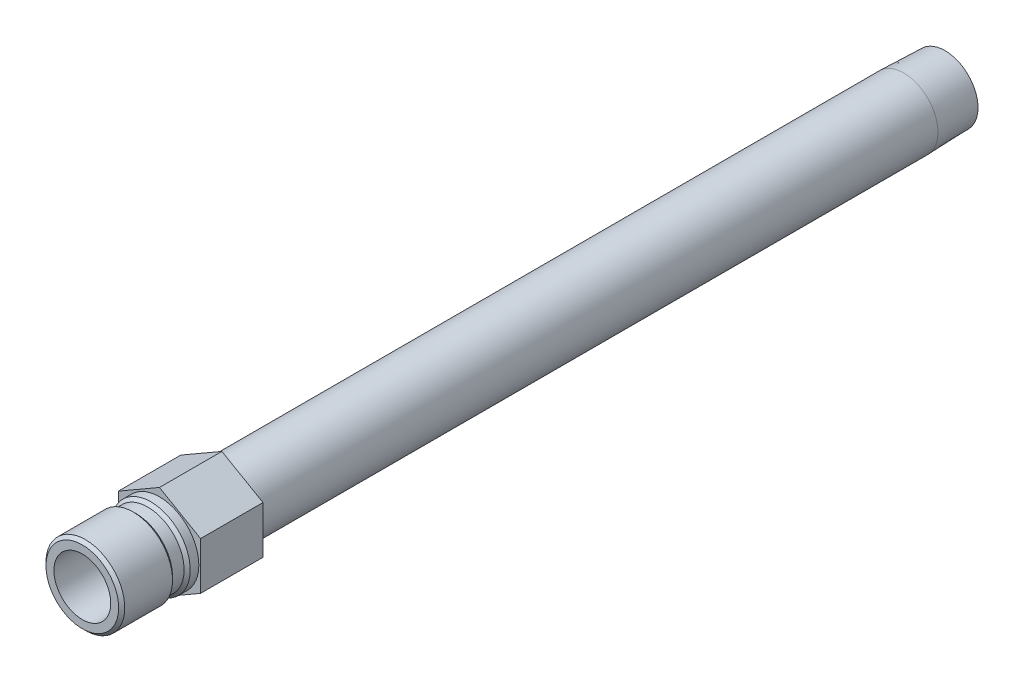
ISO-10303-21;
HEADER;
FILE_DESCRIPTION(('STEP AP214'),'2;1');
FILE_NAME('part.step','',(''),(''),'','','');
FILE_SCHEMA(('AUTOMOTIVE_DESIGN { 1 0 10303 214 1 1 1 1 }'));
ENDSEC;
DATA;
#1=APPLICATION_CONTEXT('core data for automotive mechanical design processes');
#2=APPLICATION_PROTOCOL_DEFINITION('international standard','automotive_design',2000,#1);
#3=PRODUCT_CONTEXT('',#1,'mechanical');
#4=PRODUCT('Part','Part','',(#3));
#5=PRODUCT_RELATED_PRODUCT_CATEGORY('part','',(#4));
#6=PRODUCT_DEFINITION_FORMATION('','',#4);
#7=PRODUCT_DEFINITION_CONTEXT('part definition',#1,'design');
#8=PRODUCT_DEFINITION('design','',#6,#7);
#9=PRODUCT_DEFINITION_SHAPE('','',#8);
#10=(LENGTH_UNIT() NAMED_UNIT(*) SI_UNIT(.MILLI.,.METRE.));
#11=(NAMED_UNIT(*) PLANE_ANGLE_UNIT() SI_UNIT($,.RADIAN.));
#12=(NAMED_UNIT(*) SI_UNIT($,.STERADIAN.) SOLID_ANGLE_UNIT());
#13=UNCERTAINTY_MEASURE_WITH_UNIT(LENGTH_MEASURE(1.E-05),#10,'distance_accuracy_value','');
#14=(GEOMETRIC_REPRESENTATION_CONTEXT(3) GLOBAL_UNCERTAINTY_ASSIGNED_CONTEXT((#13)) GLOBAL_UNIT_ASSIGNED_CONTEXT((#10,
#11,#12)) REPRESENTATION_CONTEXT('',''));
#15=CARTESIAN_POINT('',(0.,0.,0.));
#16=DIRECTION('',(0.,0.,1.));
#17=DIRECTION('',(1.,0.,0.));
#18=AXIS2_PLACEMENT_3D('',#15,#16,#17);
#19=CARTESIAN_POINT('',(0.,0.,0.));
#20=DIRECTION('',(0.,0.,-1.));
#21=DIRECTION('',(0.,1.,0.));
#22=AXIS2_PLACEMENT_3D('',#19,#20,#21);
#23=CYLINDRICAL_SURFACE('',#22,8.5725);
#24=CARTESIAN_POINT('',(0.,0.,-186.2582));
#25=DIRECTION('',(0.,0.,-1.));
#26=DIRECTION('',(0.,1.,0.));
#27=AXIS2_PLACEMENT_3D('',#24,#25,#26);
#28=CIRCLE('',#27,8.5725);
#29=CARTESIAN_POINT('',(0.,8.5725,-186.2582));
#30=VERTEX_POINT('',#29);
#31=EDGE_CURVE('E158',#30,#30,#28,.T.);
#32=ORIENTED_EDGE('',*,*,#31,.F.);
#33=EDGE_LOOP('',(#32));
#34=FACE_BOUND('',#33,.T.);
#35=CARTESIAN_POINT('',(0.,0.,-15.621));
#36=DIRECTION('',(0.,0.,1.));
#37=DIRECTION('',(1.,0.,0.));
#38=AXIS2_PLACEMENT_3D('',#35,#36,#37);
#39=CIRCLE('',#38,8.5725);
#40=CARTESIAN_POINT('',(8.5725,0.,-15.621));
#41=VERTEX_POINT('',#40);
#42=EDGE_CURVE('E39',#41,#41,#39,.F.);
#43=ORIENTED_EDGE('',*,*,#42,.T.);
#44=EDGE_LOOP('',(#43));
#45=FACE_BOUND('',#44,.T.);
#46=ADVANCED_FACE('F35',(#34,#45),#23,.T.);
#47=CARTESIAN_POINT('',(0.,0.,0.));
#48=DIRECTION('',(0.,0.,-1.));
#49=DIRECTION('',(0.,1.,0.));
#50=AXIS2_PLACEMENT_3D('',#47,#48,#49);
#51=CYLINDRICAL_SURFACE('',#50,7.112);
#52=CARTESIAN_POINT('',(0.,0.,1.524));
#53=DIRECTION('',(0.,0.,-1.));
#54=DIRECTION('',(0.,1.,0.));
#55=AXIS2_PLACEMENT_3D('',#52,#53,#54);
#56=CIRCLE('',#55,7.112);
#57=CARTESIAN_POINT('',(0.,7.112,1.524));
#58=VERTEX_POINT('',#57);
#59=EDGE_CURVE('E146',#58,#58,#56,.T.);
#60=ORIENTED_EDGE('',*,*,#59,.T.);
#61=EDGE_LOOP('',(#60));
#62=FACE_BOUND('',#61,.T.);
#63=CARTESIAN_POINT('',(0.,0.,19.304));
#64=DIRECTION('',(0.,0.,-1.));
#65=DIRECTION('',(0.,1.,0.));
#66=AXIS2_PLACEMENT_3D('',#63,#64,#65);
#67=CIRCLE('',#66,7.112);
#68=CARTESIAN_POINT('',(0.,7.112,19.304));
#69=VERTEX_POINT('',#68);
#70=EDGE_CURVE('E11',#69,#69,#67,.T.);
#71=ORIENTED_EDGE('',*,*,#70,.F.);
#72=EDGE_LOOP('',(#71));
#73=FACE_BOUND('',#72,.T.);
#74=ADVANCED_FACE('F37',(#62,#73),#51,.F.);
#75=CARTESIAN_POINT('',(0.,7.112,19.304));
#76=DIRECTION('',(0.,0.,1.));
#77=DIRECTION('',(0.,-1.,0.));
#78=AXIS2_PLACEMENT_3D('',#75,#76,#77);
#79=PLANE('',#78);
#80=ORIENTED_EDGE('',*,*,#70,.T.);
#81=EDGE_LOOP('',(#80));
#82=FACE_BOUND('',#81,.T.);
#83=CARTESIAN_POINT('',(0.,0.,19.304));
#84=DIRECTION('',(0.,0.,-1.));
#85=DIRECTION('',(0.,1.,0.));
#86=AXIS2_PLACEMENT_3D('',#83,#84,#85);
#87=CIRCLE('',#86,9.09319999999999);
#88=CARTESIAN_POINT('',(0.,9.0932,19.304));
#89=VERTEX_POINT('',#88);
#90=EDGE_CURVE('E45',#89,#89,#87,.T.);
#91=ORIENTED_EDGE('',*,*,#90,.F.);
#92=EDGE_LOOP('',(#91));
#93=FACE_BOUND('',#92,.T.);
#94=ADVANCED_FACE('F185',(#82,#93),#79,.T.);
#95=CARTESIAN_POINT('',(0.,0.,18.542));
#96=DIRECTION('',(0.,0.,-1.));
#97=DIRECTION('',(0.,1.,0.));
#98=AXIS2_PLACEMENT_3D('',#95,#96,#97);
#99=CONICAL_SURFACE('',#98,9.8552,0.785398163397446);
#100=ORIENTED_EDGE('',*,*,#90,.T.);
#101=EDGE_LOOP('',(#100));
#102=FACE_BOUND('',#101,.T.);
#103=CARTESIAN_POINT('',(0.,0.,18.542));
#104=DIRECTION('',(0.,0.,-1.));
#105=DIRECTION('',(0.,1.,0.));
#106=AXIS2_PLACEMENT_3D('',#103,#104,#105);
#107=CIRCLE('',#106,9.8552);
#108=CARTESIAN_POINT('',(0.,9.8552,18.542));
#109=VERTEX_POINT('',#108);
#110=EDGE_CURVE('E176',#109,#109,#107,.T.);
#111=ORIENTED_EDGE('',*,*,#110,.F.);
#112=EDGE_LOOP('',(#111));
#113=FACE_BOUND('',#112,.T.);
#114=ADVANCED_FACE('F182',(#102,#113),#99,.T.);
#115=CARTESIAN_POINT('',(0.,0.,0.));
#116=DIRECTION('',(0.,0.,-1.));
#117=DIRECTION('',(0.,1.,0.));
#118=AXIS2_PLACEMENT_3D('',#115,#116,#117);
#119=CYLINDRICAL_SURFACE('',#118,9.8552);
#120=ORIENTED_EDGE('',*,*,#110,.T.);
#121=EDGE_LOOP('',(#120));
#122=FACE_BOUND('',#121,.T.);
#123=CARTESIAN_POINT('',(0.,0.,6.5786));
#124=DIRECTION('',(0.,0.,-1.));
#125=DIRECTION('',(0.,1.,0.));
#126=AXIS2_PLACEMENT_3D('',#123,#124,#125);
#127=CIRCLE('',#126,9.8552);
#128=CARTESIAN_POINT('',(0.,9.8552,6.5786));
#129=VERTEX_POINT('',#128);
#130=EDGE_CURVE('E173',#129,#129,#127,.T.);
#131=ORIENTED_EDGE('',*,*,#130,.F.);
#132=EDGE_LOOP('',(#131));
#133=FACE_BOUND('',#132,.T.);
#134=ADVANCED_FACE('F192',(#122,#133),#119,.T.);
#135=CARTESIAN_POINT('',(0.,0.,5.8166));
#136=DIRECTION('',(0.,0.,1.));
#137=DIRECTION('',(0.,-1.,0.));
#138=AXIS2_PLACEMENT_3D('',#135,#136,#137);
#139=CONICAL_SURFACE('',#138,9.0932,0.785398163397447);
#140=ORIENTED_EDGE('',*,*,#130,.T.);
#141=EDGE_LOOP('',(#140));
#142=FACE_BOUND('',#141,.T.);
#143=CARTESIAN_POINT('',(0.,0.,5.8166));
#144=DIRECTION('',(0.,0.,-1.));
#145=DIRECTION('',(0.,1.,0.));
#146=AXIS2_PLACEMENT_3D('',#143,#144,#145);
#147=CIRCLE('',#146,9.0932);
#148=CARTESIAN_POINT('',(0.,9.0932,5.8166));
#149=VERTEX_POINT('',#148);
#150=EDGE_CURVE('E170',#149,#149,#147,.T.);
#151=ORIENTED_EDGE('',*,*,#150,.F.);
#152=EDGE_LOOP('',(#151));
#153=FACE_BOUND('',#152,.T.);
#154=ADVANCED_FACE('F217',(#142,#153),#139,.T.);
#155=CARTESIAN_POINT('',(0.,0.,0.));
#156=DIRECTION('',(0.,0.,-1.));
#157=DIRECTION('',(0.,1.,0.));
#158=AXIS2_PLACEMENT_3D('',#155,#156,#157);
#159=CYLINDRICAL_SURFACE('',#158,9.0932);
#160=ORIENTED_EDGE('',*,*,#150,.T.);
#161=EDGE_LOOP('',(#160));
#162=FACE_BOUND('',#161,.T.);
#163=CARTESIAN_POINT('',(0.,0.,2.921));
#164=DIRECTION('',(0.,0.,-1.));
#165=DIRECTION('',(0.,1.,0.));
#166=AXIS2_PLACEMENT_3D('',#163,#164,#165);
#167=CIRCLE('',#166,9.0932);
#168=CARTESIAN_POINT('',(0.,9.0932,2.921));
#169=VERTEX_POINT('',#168);
#170=EDGE_CURVE('E167',#169,#169,#167,.T.);
#171=ORIENTED_EDGE('',*,*,#170,.F.);
#172=EDGE_LOOP('',(#171));
#173=FACE_BOUND('',#172,.T.);
#174=ADVANCED_FACE('F213',(#162,#173),#159,.T.);
#175=CARTESIAN_POINT('',(0.,0.,2.159));
#176=DIRECTION('',(0.,0.,-1.));
#177=DIRECTION('',(0.,1.,0.));
#178=AXIS2_PLACEMENT_3D('',#175,#176,#177);
#179=CONICAL_SURFACE('',#178,9.8552,0.785398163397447);
#180=ORIENTED_EDGE('',*,*,#170,.T.);
#181=EDGE_LOOP('',(#180));
#182=FACE_BOUND('',#181,.T.);
#183=CARTESIAN_POINT('',(0.,0.,2.159));
#184=DIRECTION('',(0.,0.,-1.));
#185=DIRECTION('',(0.,1.,0.));
#186=AXIS2_PLACEMENT_3D('',#183,#184,#185);
#187=CIRCLE('',#186,9.8552);
#188=CARTESIAN_POINT('',(0.,9.8552,2.159));
#189=VERTEX_POINT('',#188);
#190=EDGE_CURVE('E164',#189,#189,#187,.T.);
#191=ORIENTED_EDGE('',*,*,#190,.F.);
#192=EDGE_LOOP('',(#191));
#193=FACE_BOUND('',#192,.T.);
#194=ADVANCED_FACE('F209',(#182,#193),#179,.T.);
#195=CARTESIAN_POINT('',(0.,0.,0.));
#196=DIRECTION('',(0.,0.,-1.));
#197=DIRECTION('',(0.,1.,0.));
#198=AXIS2_PLACEMENT_3D('',#195,#196,#197);
#199=CYLINDRICAL_SURFACE('',#198,9.8552);
#200=ORIENTED_EDGE('',*,*,#190,.T.);
#201=EDGE_LOOP('',(#200));
#202=FACE_BOUND('',#201,.T.);
#203=CARTESIAN_POINT('',(0.,0.,0.));
#204=DIRECTION('',(0.,0.,-1.));
#205=DIRECTION('',(0.,1.,0.));
#206=AXIS2_PLACEMENT_3D('',#203,#204,#205);
#207=CIRCLE('',#206,9.8552);
#208=CARTESIAN_POINT('',(0.,9.8552,0.));
#209=VERTEX_POINT('',#208);
#210=EDGE_CURVE('E161',#209,#209,#207,.T.);
#211=ORIENTED_EDGE('',*,*,#210,.F.);
#212=EDGE_LOOP('',(#211));
#213=FACE_BOUND('',#212,.T.);
#214=ADVANCED_FACE('F206',(#202,#213),#199,.T.);
#215=CARTESIAN_POINT('',(0.,0.,-196.596));
#216=DIRECTION('',(0.,0.,1.));
#217=DIRECTION('',(0.,-1.,0.));
#218=AXIS2_PLACEMENT_3D('',#215,#216,#217);
#219=CONICAL_SURFACE('',#218,8.24944566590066,0.0312396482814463);
#220=ORIENTED_EDGE('',*,*,#31,.T.);
#221=EDGE_LOOP('',(#220));
#222=FACE_BOUND('',#221,.T.);
#223=CARTESIAN_POINT('',(0.,0.,-196.596));
#224=DIRECTION('',(0.,0.,-1.));
#225=DIRECTION('',(0.,1.,0.));
#226=AXIS2_PLACEMENT_3D('',#223,#224,#225);
#227=CIRCLE('',#226,8.24944566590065);
#228=CARTESIAN_POINT('',(0.,8.24944566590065,-196.596));
#229=VERTEX_POINT('',#228);
#230=EDGE_CURVE('E155',#229,#229,#227,.T.);
#231=ORIENTED_EDGE('',*,*,#230,.F.);
#232=EDGE_LOOP('',(#231));
#233=FACE_BOUND('',#232,.T.);
#234=ADVANCED_FACE('F204',(#222,#233),#219,.T.);
#235=CARTESIAN_POINT('',(0.,8.24944566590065,-196.596));
#236=DIRECTION('',(0.,0.,-1.));
#237=DIRECTION('',(0.,1.,0.));
#238=AXIS2_PLACEMENT_3D('',#235,#236,#237);
#239=PLANE('',#238);
#240=ORIENTED_EDGE('',*,*,#230,.T.);
#241=EDGE_LOOP('',(#240));
#242=FACE_BOUND('',#241,.T.);
#243=CARTESIAN_POINT('',(0.,0.,-196.596));
#244=DIRECTION('',(0.,0.,-1.));
#245=DIRECTION('',(0.,1.,0.));
#246=AXIS2_PLACEMENT_3D('',#243,#244,#245);
#247=CIRCLE('',#246,6.2611);
#248=CARTESIAN_POINT('',(0.,6.2611,-196.596));
#249=VERTEX_POINT('',#248);
#250=EDGE_CURVE('E152',#249,#249,#247,.T.);
#251=ORIENTED_EDGE('',*,*,#250,.F.);
#252=EDGE_LOOP('',(#251));
#253=FACE_BOUND('',#252,.T.);
#254=ADVANCED_FACE('F270',(#242,#253),#239,.T.);
#255=CARTESIAN_POINT('',(0.,0.,0.));
#256=DIRECTION('',(0.,0.,-1.));
#257=DIRECTION('',(0.,1.,0.));
#258=AXIS2_PLACEMENT_3D('',#255,#256,#257);
#259=CYLINDRICAL_SURFACE('',#258,6.2611);
#260=ORIENTED_EDGE('',*,*,#250,.T.);
#261=EDGE_LOOP('',(#260));
#262=FACE_BOUND('',#261,.T.);
#263=CARTESIAN_POINT('',(0.,0.,1.07156844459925));
#264=DIRECTION('',(0.,0.,-1.));
#265=DIRECTION('',(0.,1.,0.));
#266=AXIS2_PLACEMENT_3D('',#263,#264,#265);
#267=CIRCLE('',#266,6.2611);
#268=CARTESIAN_POINT('',(0.,6.2611,1.07156844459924));
#269=VERTEX_POINT('',#268);
#270=EDGE_CURVE('E149',#269,#269,#267,.T.);
#271=ORIENTED_EDGE('',*,*,#270,.F.);
#272=EDGE_LOOP('',(#271));
#273=FACE_BOUND('',#272,.T.);
#274=ADVANCED_FACE('F267',(#262,#273),#259,.F.);
#275=CARTESIAN_POINT('',(0.,0.,1.524));
#276=DIRECTION('',(0.,0.,1.));
#277=DIRECTION('',(0.,-1.,0.));
#278=AXIS2_PLACEMENT_3D('',#275,#276,#277);
#279=CONICAL_SURFACE('',#278,7.112,1.08210413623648);
#280=ORIENTED_EDGE('',*,*,#270,.T.);
#281=EDGE_LOOP('',(#280));
#282=FACE_BOUND('',#281,.T.);
#283=ORIENTED_EDGE('',*,*,#59,.F.);
#284=EDGE_LOOP('',(#283));
#285=FACE_BOUND('',#284,.T.);
#286=ADVANCED_FACE('F255',(#282,#285),#279,.F.);
#287=CARTESIAN_POINT('',(0.,11.8784044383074,-15.621));
#288=DIRECTION('',(-0.5,0.866025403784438,0.));
#289=DIRECTION('',(-0.866025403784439,-0.5,0.));
#290=AXIS2_PLACEMENT_3D('',#287,#288,#289);
#291=PLANE('',#290);
#292=DIRECTION('',(-0.866025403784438,-0.5,0.));
#293=VECTOR('',#292,1.);
#294=CARTESIAN_POINT('',(0.,11.8784044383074,0.));
#295=LINE('',#294,#293);
#296=CARTESIAN_POINT('',(0.,11.8784044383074,0.));
#297=VERTEX_POINT('',#296);
#298=CARTESIAN_POINT('',(-10.287,5.93920221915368,0.));
#299=VERTEX_POINT('',#298);
#300=EDGE_CURVE('E124',#297,#299,#295,.T.);
#301=ORIENTED_EDGE('',*,*,#300,.F.);
#302=DIRECTION('',(0.,0.,1.));
#303=VECTOR('',#302,1.);
#304=CARTESIAN_POINT('',(0.,11.8784044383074,-15.621));
#305=LINE('',#304,#303);
#306=CARTESIAN_POINT('',(0.,11.8784044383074,-15.621));
#307=VERTEX_POINT('',#306);
#308=EDGE_CURVE('E53',#307,#297,#305,.T.);
#309=ORIENTED_EDGE('',*,*,#308,.F.);
#310=DIRECTION('',(-0.866025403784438,-0.5,0.));
#311=VECTOR('',#310,1.);
#312=CARTESIAN_POINT('',(0.,11.8784044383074,-15.621));
#313=LINE('',#312,#311);
#314=CARTESIAN_POINT('',(-10.287,5.93920221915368,-15.621));
#315=VERTEX_POINT('',#314);
#316=EDGE_CURVE('E139',#307,#315,#313,.T.);
#317=ORIENTED_EDGE('',*,*,#316,.T.);
#318=DIRECTION('',(0.,0.,1.));
#319=VECTOR('',#318,1.);
#320=CARTESIAN_POINT('',(-10.287,5.93920221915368,-15.621));
#321=LINE('',#320,#319);
#322=EDGE_CURVE('E88',#315,#299,#321,.T.);
#323=ORIENTED_EDGE('',*,*,#322,.T.);
#324=EDGE_LOOP('',(#301,#309,#317,#323));
#325=FACE_BOUND('',#324,.T.);
#326=ADVANCED_FACE('F242',(#325),#291,.T.);
#327=CARTESIAN_POINT('',(10.287,5.93920221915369,-15.621));
#328=DIRECTION('',(0.5,0.866025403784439,0.));
#329=DIRECTION('',(-0.866025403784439,0.5,0.));
#330=AXIS2_PLACEMENT_3D('',#327,#328,#329);
#331=PLANE('',#330);
#332=DIRECTION('',(-0.866025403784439,0.5,0.));
#333=VECTOR('',#332,1.);
#334=CARTESIAN_POINT('',(10.287,5.93920221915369,0.));
#335=LINE('',#334,#333);
#336=CARTESIAN_POINT('',(10.287,5.93920221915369,0.));
#337=VERTEX_POINT('',#336);
#338=EDGE_CURVE('E136',#337,#297,#335,.T.);
#339=ORIENTED_EDGE('',*,*,#338,.F.);
#340=DIRECTION('',(0.,0.,1.));
#341=VECTOR('',#340,1.);
#342=CARTESIAN_POINT('',(10.287,5.93920221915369,-15.621));
#343=LINE('',#342,#341);
#344=CARTESIAN_POINT('',(10.287,5.93920221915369,-15.621));
#345=VERTEX_POINT('',#344);
#346=EDGE_CURVE('E76',#345,#337,#343,.T.);
#347=ORIENTED_EDGE('',*,*,#346,.F.);
#348=DIRECTION('',(-0.866025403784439,0.5,0.));
#349=VECTOR('',#348,1.);
#350=CARTESIAN_POINT('',(10.287,5.93920221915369,-15.621));
#351=LINE('',#350,#349);
#352=EDGE_CURVE('E114',#345,#307,#351,.T.);
#353=ORIENTED_EDGE('',*,*,#352,.T.);
#354=ORIENTED_EDGE('',*,*,#308,.T.);
#355=EDGE_LOOP('',(#339,#347,#353,#354));
#356=FACE_BOUND('',#355,.T.);
#357=ADVANCED_FACE('F247',(#356),#331,.T.);
#358=CARTESIAN_POINT('',(10.287,-5.93920221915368,-15.621));
#359=DIRECTION('',(1.,0.,0.));
#360=DIRECTION('',(0.,0.,-1.));
#361=AXIS2_PLACEMENT_3D('',#358,#359,#360);
#362=PLANE('',#361);
#363=DIRECTION('',(0.,1.,0.));
#364=VECTOR('',#363,1.);
#365=CARTESIAN_POINT('',(10.287,-5.93920221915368,0.));
#366=LINE('',#365,#364);
#367=CARTESIAN_POINT('',(10.287,-5.93920221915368,0.));
#368=VERTEX_POINT('',#367);
#369=EDGE_CURVE('E101',#368,#337,#366,.T.);
#370=ORIENTED_EDGE('',*,*,#369,.F.);
#371=DIRECTION('',(0.,0.,1.));
#372=VECTOR('',#371,1.);
#373=CARTESIAN_POINT('',(10.287,-5.93920221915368,-15.621));
#374=LINE('',#373,#372);
#375=CARTESIAN_POINT('',(10.287,-5.93920221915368,-15.621));
#376=VERTEX_POINT('',#375);
#377=EDGE_CURVE('E96',#376,#368,#374,.T.);
#378=ORIENTED_EDGE('',*,*,#377,.F.);
#379=DIRECTION('',(0.,1.,0.));
#380=VECTOR('',#379,1.);
#381=CARTESIAN_POINT('',(10.287,-5.93920221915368,-15.621));
#382=LINE('',#381,#380);
#383=EDGE_CURVE('E99',#376,#345,#382,.T.);
#384=ORIENTED_EDGE('',*,*,#383,.T.);
#385=ORIENTED_EDGE('',*,*,#346,.T.);
#386=EDGE_LOOP('',(#370,#378,#384,#385));
#387=FACE_BOUND('',#386,.T.);
#388=ADVANCED_FACE('F98',(#387),#362,.T.);
#389=CARTESIAN_POINT('',(0.,-11.8784044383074,-15.621));
#390=DIRECTION('',(0.5,-0.866025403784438,0.));
#391=DIRECTION('',(0.866025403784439,0.5,0.));
#392=AXIS2_PLACEMENT_3D('',#389,#390,#391);
#393=PLANE('',#392);
#394=DIRECTION('',(0.866025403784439,0.5,0.));
#395=VECTOR('',#394,1.);
#396=CARTESIAN_POINT('',(0.,-11.8784044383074,0.));
#397=LINE('',#396,#395);
#398=CARTESIAN_POINT('',(0.,-11.8784044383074,0.));
#399=VERTEX_POINT('',#398);
#400=EDGE_CURVE('E133',#399,#368,#397,.T.);
#401=ORIENTED_EDGE('',*,*,#400,.F.);
#402=DIRECTION('',(0.,0.,1.));
#403=VECTOR('',#402,1.);
#404=CARTESIAN_POINT('',(0.,-11.8784044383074,-15.621));
#405=LINE('',#404,#403);
#406=CARTESIAN_POINT('',(0.,-11.8784044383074,-15.621));
#407=VERTEX_POINT('',#406);
#408=EDGE_CURVE('E106',#407,#399,#405,.T.);
#409=ORIENTED_EDGE('',*,*,#408,.F.);
#410=DIRECTION('',(0.866025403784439,0.5,0.));
#411=VECTOR('',#410,1.);
#412=CARTESIAN_POINT('',(0.,-11.8784044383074,-15.621));
#413=LINE('',#412,#411);
#414=EDGE_CURVE('E112',#407,#376,#413,.T.);
#415=ORIENTED_EDGE('',*,*,#414,.T.);
#416=ORIENTED_EDGE('',*,*,#377,.T.);
#417=EDGE_LOOP('',(#401,#409,#415,#416));
#418=FACE_BOUND('',#417,.T.);
#419=ADVANCED_FACE('F116',(#418),#393,.T.);
#420=CARTESIAN_POINT('',(-10.287,-5.93920221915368,-15.621));
#421=DIRECTION('',(-0.5,-0.866025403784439,0.));
#422=DIRECTION('',(0.866025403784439,-0.5,0.));
#423=AXIS2_PLACEMENT_3D('',#420,#421,#422);
#424=PLANE('',#423);
#425=DIRECTION('',(0.866025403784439,-0.5,0.));
#426=VECTOR('',#425,1.);
#427=CARTESIAN_POINT('',(-10.287,-5.93920221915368,0.));
#428=LINE('',#427,#426);
#429=CARTESIAN_POINT('',(-10.287,-5.93920221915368,0.));
#430=VERTEX_POINT('',#429);
#431=EDGE_CURVE('E130',#430,#399,#428,.T.);
#432=ORIENTED_EDGE('',*,*,#431,.F.);
#433=DIRECTION('',(0.,0.,1.));
#434=VECTOR('',#433,1.);
#435=CARTESIAN_POINT('',(-10.287,-5.93920221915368,-15.621));
#436=LINE('',#435,#434);
#437=CARTESIAN_POINT('',(-10.287,-5.93920221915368,-15.621));
#438=VERTEX_POINT('',#437);
#439=EDGE_CURVE('E143',#438,#430,#436,.T.);
#440=ORIENTED_EDGE('',*,*,#439,.F.);
#441=DIRECTION('',(0.866025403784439,-0.5,0.));
#442=VECTOR('',#441,1.);
#443=CARTESIAN_POINT('',(-10.287,-5.93920221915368,-15.621));
#444=LINE('',#443,#442);
#445=EDGE_CURVE('E117',#438,#407,#444,.T.);
#446=ORIENTED_EDGE('',*,*,#445,.T.);
#447=ORIENTED_EDGE('',*,*,#408,.T.);
#448=EDGE_LOOP('',(#432,#440,#446,#447));
#449=FACE_BOUND('',#448,.T.);
#450=ADVANCED_FACE('F246',(#449),#424,.T.);
#451=CARTESIAN_POINT('',(-10.287,5.93920221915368,-15.621));
#452=DIRECTION('',(-1.,0.,0.));
#453=DIRECTION('',(0.,0.,1.));
#454=AXIS2_PLACEMENT_3D('',#451,#452,#453);
#455=PLANE('',#454);
#456=DIRECTION('',(0.,-1.,0.));
#457=VECTOR('',#456,1.);
#458=CARTESIAN_POINT('',(-10.287,5.93920221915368,0.));
#459=LINE('',#458,#457);
#460=EDGE_CURVE('E127',#299,#430,#459,.T.);
#461=ORIENTED_EDGE('',*,*,#460,.F.);
#462=ORIENTED_EDGE('',*,*,#322,.F.);
#463=DIRECTION('',(0.,-1.,0.));
#464=VECTOR('',#463,1.);
#465=CARTESIAN_POINT('',(-10.287,5.93920221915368,-15.621));
#466=LINE('',#465,#464);
#467=EDGE_CURVE('E119',#315,#438,#466,.T.);
#468=ORIENTED_EDGE('',*,*,#467,.T.);
#469=ORIENTED_EDGE('',*,*,#439,.T.);
#470=EDGE_LOOP('',(#461,#462,#468,#469));
#471=FACE_BOUND('',#470,.T.);
#472=ADVANCED_FACE('F243',(#471),#455,.T.);
#473=CARTESIAN_POINT('',(-10.287,5.93920221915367,-15.621));
#474=DIRECTION('',(0.,0.,1.));
#475=DIRECTION('',(1.,0.,0.));
#476=AXIS2_PLACEMENT_3D('',#473,#474,#475);
#477=PLANE('',#476);
#478=ORIENTED_EDGE('',*,*,#42,.F.);
#479=EDGE_LOOP('',(#478));
#480=FACE_BOUND('',#479,.T.);
#481=ORIENTED_EDGE('',*,*,#316,.F.);
#482=ORIENTED_EDGE('',*,*,#352,.F.);
#483=ORIENTED_EDGE('',*,*,#383,.F.);
#484=ORIENTED_EDGE('',*,*,#414,.F.);
#485=ORIENTED_EDGE('',*,*,#445,.F.);
#486=ORIENTED_EDGE('',*,*,#467,.F.);
#487=EDGE_LOOP('',(#481,#482,#483,#484,#485,#486));
#488=FACE_BOUND('',#487,.T.);
#489=ADVANCED_FACE('F110',(#480,#488),#477,.F.);
#490=CARTESIAN_POINT('',(-10.287,5.93920221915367,0.));
#491=DIRECTION('',(0.,0.,1.));
#492=DIRECTION('',(1.,0.,0.));
#493=AXIS2_PLACEMENT_3D('',#490,#491,#492);
#494=PLANE('',#493);
#495=ORIENTED_EDGE('',*,*,#210,.T.);
#496=EDGE_LOOP('',(#495));
#497=FACE_BOUND('',#496,.T.);
#498=ORIENTED_EDGE('',*,*,#300,.T.);
#499=ORIENTED_EDGE('',*,*,#460,.T.);
#500=ORIENTED_EDGE('',*,*,#431,.T.);
#501=ORIENTED_EDGE('',*,*,#400,.T.);
#502=ORIENTED_EDGE('',*,*,#369,.T.);
#503=ORIENTED_EDGE('',*,*,#338,.T.);
#504=EDGE_LOOP('',(#498,#499,#500,#501,#502,#503));
#505=FACE_BOUND('',#504,.T.);
#506=ADVANCED_FACE('F238',(#497,#505),#494,.T.);
#507=CLOSED_SHELL('',(#46,#74,#94,#114,#134,#154,#174,#194,#214,#234,#254,#274,#286,#326,#357,
#388,#419,#450,#472,#489,#506));
#508=MANIFOLD_SOLID_BREP('B2',#507);
#509=ADVANCED_BREP_SHAPE_REPRESENTATION('',(#18,#508),#14);
#510=SHAPE_DEFINITION_REPRESENTATION(#9,#509);
ENDSEC;
END-ISO-10303-21;
